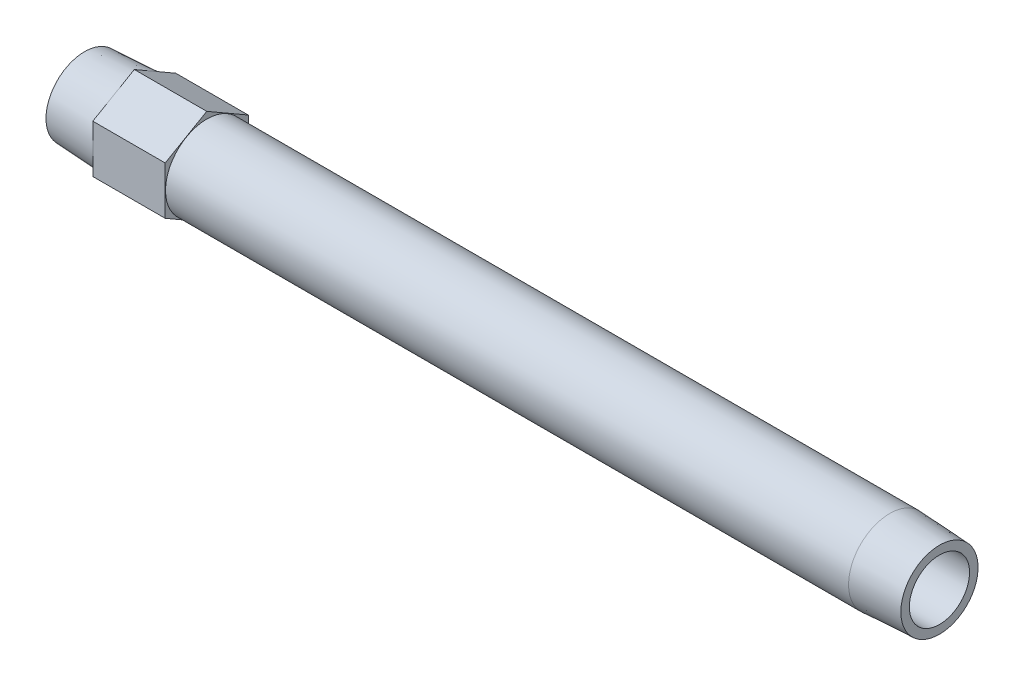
ISO-10303-21;
HEADER;
FILE_DESCRIPTION(('STEP AP214'),'2;1');
FILE_NAME('part.step','',(''),(''),'','','');
FILE_SCHEMA(('AUTOMOTIVE_DESIGN { 1 0 10303 214 1 1 1 1 }'));
ENDSEC;
DATA;
#1=APPLICATION_CONTEXT('core data for automotive mechanical design processes');
#2=APPLICATION_PROTOCOL_DEFINITION('international standard','automotive_design',2000,#1);
#3=PRODUCT_CONTEXT('',#1,'mechanical');
#4=PRODUCT('Part','Part','',(#3));
#5=PRODUCT_RELATED_PRODUCT_CATEGORY('part','',(#4));
#6=PRODUCT_DEFINITION_FORMATION('','',#4);
#7=PRODUCT_DEFINITION_CONTEXT('part definition',#1,'design');
#8=PRODUCT_DEFINITION('design','',#6,#7);
#9=PRODUCT_DEFINITION_SHAPE('','',#8);
#10=(LENGTH_UNIT() NAMED_UNIT(*) SI_UNIT(.MILLI.,.METRE.));
#11=(NAMED_UNIT(*) PLANE_ANGLE_UNIT() SI_UNIT($,.RADIAN.));
#12=(NAMED_UNIT(*) SI_UNIT($,.STERADIAN.) SOLID_ANGLE_UNIT());
#13=UNCERTAINTY_MEASURE_WITH_UNIT(LENGTH_MEASURE(1.E-05),#10,'distance_accuracy_value','');
#14=(GEOMETRIC_REPRESENTATION_CONTEXT(3) GLOBAL_UNCERTAINTY_ASSIGNED_CONTEXT((#13)) GLOBAL_UNIT_ASSIGNED_CONTEXT((#10,
#11,#12)) REPRESENTATION_CONTEXT('',''));
#15=CARTESIAN_POINT('',(0.,0.,0.));
#16=DIRECTION('',(0.,0.,1.));
#17=DIRECTION('',(1.,0.,0.));
#18=AXIS2_PLACEMENT_3D('',#15,#16,#17);
#19=CARTESIAN_POINT('',(0.,0.,-8.03071885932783));
#20=DIRECTION('',(1.,0.,0.));
#21=DIRECTION('',(0.,0.,-1.));
#22=AXIS2_PLACEMENT_3D('',#19,#20,#21);
#23=PLANE('',#22);
#24=CARTESIAN_POINT('',(0.,0.,0.));
#25=DIRECTION('',(-1.,0.,0.));
#26=DIRECTION('',(0.,0.,1.));
#27=AXIS2_PLACEMENT_3D('',#24,#25,#26);
#28=CIRCLE('',#27,8.03071885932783);
#29=CARTESIAN_POINT('',(0.,0.,8.03071885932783));
#30=VERTEX_POINT('',#29);
#31=EDGE_CURVE('E147',#30,#30,#28,.T.);
#32=ORIENTED_EDGE('',*,*,#31,.T.);
#33=EDGE_LOOP('',(#32));
#34=FACE_BOUND('',#33,.T.);
#35=CARTESIAN_POINT('',(0.,0.,0.));
#36=DIRECTION('',(1.,0.,0.));
#37=DIRECTION('',(0.,0.,1.));
#38=AXIS2_PLACEMENT_3D('',#35,#36,#37);
#39=CIRCLE('',#38,6.2611);
#40=CARTESIAN_POINT('',(0.,0.,6.2611));
#41=VERTEX_POINT('',#40);
#42=EDGE_CURVE('E159',#41,#41,#39,.T.);
#43=ORIENTED_EDGE('',*,*,#42,.T.);
#44=EDGE_LOOP('',(#43));
#45=FACE_BOUND('',#44,.T.);
#46=ADVANCED_FACE('F15',(#34,#45),#23,.F.);
#47=CARTESIAN_POINT('',(177.8,0.,-8.0307188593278));
#48=DIRECTION('',(-1.,0.,0.));
#49=DIRECTION('',(0.,0.,1.));
#50=AXIS2_PLACEMENT_3D('',#47,#48,#49);
#51=PLANE('',#50);
#52=CARTESIAN_POINT('',(177.8,0.,0.));
#53=DIRECTION('',(-1.,0.,0.));
#54=DIRECTION('',(0.,0.,1.));
#55=AXIS2_PLACEMENT_3D('',#52,#53,#54);
#56=CIRCLE('',#55,8.0307188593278);
#57=CARTESIAN_POINT('',(177.8,0.,8.0307188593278));
#58=VERTEX_POINT('',#57);
#59=EDGE_CURVE('E150',#58,#58,#56,.T.);
#60=ORIENTED_EDGE('',*,*,#59,.F.);
#61=EDGE_LOOP('',(#60));
#62=FACE_BOUND('',#61,.T.);
#63=CARTESIAN_POINT('',(177.8,0.,0.));
#64=DIRECTION('',(-1.,0.,0.));
#65=DIRECTION('',(0.,0.,1.));
#66=AXIS2_PLACEMENT_3D('',#63,#64,#65);
#67=CIRCLE('',#66,6.2611);
#68=CARTESIAN_POINT('',(177.8,0.,6.2611));
#69=VERTEX_POINT('',#68);
#70=EDGE_CURVE('E156',#69,#69,#67,.F.);
#71=ORIENTED_EDGE('',*,*,#70,.F.);
#72=EDGE_LOOP('',(#71));
#73=FACE_BOUND('',#72,.T.);
#74=ADVANCED_FACE('F178',(#62,#73),#51,.F.);
#75=CARTESIAN_POINT('',(25.4,-4.9859969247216,-8.636));
#76=DIRECTION('',(1.,0.,0.));
#77=DIRECTION('',(0.,1.,0.));
#78=AXIS2_PLACEMENT_3D('',#75,#76,#77);
#79=PLANE('',#78);
#80=DIRECTION('',(0.,0.5,-0.866025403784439));
#81=VECTOR('',#80,1.);
#82=CARTESIAN_POINT('',(25.4,-9.97199384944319,0.));
#83=LINE('',#82,#81);
#84=CARTESIAN_POINT('',(25.4,-9.97199384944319,0.));
#85=VERTEX_POINT('',#84);
#86=CARTESIAN_POINT('',(25.4,-4.9859969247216,-8.636));
#87=VERTEX_POINT('',#86);
#88=EDGE_CURVE('E103',#85,#87,#83,.T.);
#89=ORIENTED_EDGE('',*,*,#88,.T.);
#90=DIRECTION('',(0.,1.,0.));
#91=VECTOR('',#90,1.);
#92=CARTESIAN_POINT('',(25.4,-4.9859969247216,-8.636));
#93=LINE('',#92,#91);
#94=CARTESIAN_POINT('',(25.4,4.9859969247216,-8.636));
#95=VERTEX_POINT('',#94);
#96=EDGE_CURVE('E83',#87,#95,#93,.T.);
#97=ORIENTED_EDGE('',*,*,#96,.T.);
#98=DIRECTION('',(0.,0.5,0.866025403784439));
#99=VECTOR('',#98,1.);
#100=CARTESIAN_POINT('',(25.4,4.9859969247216,-8.636));
#101=LINE('',#100,#99);
#102=CARTESIAN_POINT('',(25.4,9.97199384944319,0.));
#103=VERTEX_POINT('',#102);
#104=EDGE_CURVE('E102',#95,#103,#101,.T.);
#105=ORIENTED_EDGE('',*,*,#104,.T.);
#106=DIRECTION('',(0.,-0.5,0.866025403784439));
#107=VECTOR('',#106,1.);
#108=CARTESIAN_POINT('',(25.4,9.97199384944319,0.));
#109=LINE('',#108,#107);
#110=CARTESIAN_POINT('',(25.4,4.9859969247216,8.636));
#111=VERTEX_POINT('',#110);
#112=EDGE_CURVE('E105',#103,#111,#109,.T.);
#113=ORIENTED_EDGE('',*,*,#112,.T.);
#114=DIRECTION('',(0.,-1.,0.));
#115=VECTOR('',#114,1.);
#116=CARTESIAN_POINT('',(25.4,4.9859969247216,8.636));
#117=LINE('',#116,#115);
#118=CARTESIAN_POINT('',(25.4,-4.9859969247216,8.636));
#119=VERTEX_POINT('',#118);
#120=EDGE_CURVE('E35',#111,#119,#117,.T.);
#121=ORIENTED_EDGE('',*,*,#120,.T.);
#122=DIRECTION('',(0.,-0.5,-0.866025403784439));
#123=VECTOR('',#122,1.);
#124=CARTESIAN_POINT('',(25.4,-4.9859969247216,8.636));
#125=LINE('',#124,#123);
#126=EDGE_CURVE('E30',#119,#85,#125,.T.);
#127=ORIENTED_EDGE('',*,*,#126,.T.);
#128=EDGE_LOOP('',(#89,#97,#105,#113,#121,#127));
#129=FACE_BOUND('',#128,.T.);
#130=CARTESIAN_POINT('',(25.4,0.,0.));
#131=DIRECTION('',(1.,0.,0.));
#132=DIRECTION('',(0.,1.,0.));
#133=AXIS2_PLACEMENT_3D('',#130,#131,#132);
#134=CIRCLE('',#133,8.5725);
#135=CARTESIAN_POINT('',(25.4,8.5725,0.));
#136=VERTEX_POINT('',#135);
#137=EDGE_CURVE('E89',#136,#136,#134,.F.);
#138=ORIENTED_EDGE('',*,*,#137,.T.);
#139=EDGE_LOOP('',(#138));
#140=FACE_BOUND('',#139,.T.);
#141=ADVANCED_FACE('F124',(#129,#140),#79,.T.);
#142=CARTESIAN_POINT('',(10.3378,-4.9859969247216,-8.636));
#143=DIRECTION('',(1.,0.,0.));
#144=DIRECTION('',(0.,1.,0.));
#145=AXIS2_PLACEMENT_3D('',#142,#143,#144);
#146=PLANE('',#145);
#147=DIRECTION('',(0.,0.5,-0.866025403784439));
#148=VECTOR('',#147,1.);
#149=CARTESIAN_POINT('',(10.3378,-9.97199384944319,0.));
#150=LINE('',#149,#148);
#151=CARTESIAN_POINT('',(10.3378,-9.97199384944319,0.));
#152=VERTEX_POINT('',#151);
#153=CARTESIAN_POINT('',(10.3378,-4.9859969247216,-8.636));
#154=VERTEX_POINT('',#153);
#155=EDGE_CURVE('E73',#152,#154,#150,.T.);
#156=ORIENTED_EDGE('',*,*,#155,.F.);
#157=DIRECTION('',(0.,-0.5,-0.866025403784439));
#158=VECTOR('',#157,1.);
#159=CARTESIAN_POINT('',(10.3378,-4.9859969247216,8.636));
#160=LINE('',#159,#158);
#161=CARTESIAN_POINT('',(10.3378,-4.9859969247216,8.636));
#162=VERTEX_POINT('',#161);
#163=EDGE_CURVE('E99',#162,#152,#160,.T.);
#164=ORIENTED_EDGE('',*,*,#163,.F.);
#165=DIRECTION('',(0.,-1.,0.));
#166=VECTOR('',#165,1.);
#167=CARTESIAN_POINT('',(10.3378,4.9859969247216,8.636));
#168=LINE('',#167,#166);
#169=CARTESIAN_POINT('',(10.3378,4.9859969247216,8.636));
#170=VERTEX_POINT('',#169);
#171=EDGE_CURVE('E133',#170,#162,#168,.T.);
#172=ORIENTED_EDGE('',*,*,#171,.F.);
#173=DIRECTION('',(0.,-0.5,0.866025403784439));
#174=VECTOR('',#173,1.);
#175=CARTESIAN_POINT('',(10.3378,9.97199384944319,0.));
#176=LINE('',#175,#174);
#177=CARTESIAN_POINT('',(10.3378,9.97199384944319,0.));
#178=VERTEX_POINT('',#177);
#179=EDGE_CURVE('E129',#178,#170,#176,.T.);
#180=ORIENTED_EDGE('',*,*,#179,.F.);
#181=DIRECTION('',(0.,0.5,0.866025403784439));
#182=VECTOR('',#181,1.);
#183=CARTESIAN_POINT('',(10.3378,4.9859969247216,-8.636));
#184=LINE('',#183,#182);
#185=CARTESIAN_POINT('',(10.3378,4.9859969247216,-8.636));
#186=VERTEX_POINT('',#185);
#187=EDGE_CURVE('E75',#186,#178,#184,.T.);
#188=ORIENTED_EDGE('',*,*,#187,.F.);
#189=DIRECTION('',(0.,1.,0.));
#190=VECTOR('',#189,1.);
#191=CARTESIAN_POINT('',(10.3378,-4.9859969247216,-8.636));
#192=LINE('',#191,#190);
#193=EDGE_CURVE('E68',#154,#186,#192,.T.);
#194=ORIENTED_EDGE('',*,*,#193,.F.);
#195=EDGE_LOOP('',(#156,#164,#172,#180,#188,#194));
#196=FACE_BOUND('',#195,.T.);
#197=CARTESIAN_POINT('',(10.3378,0.,0.));
#198=DIRECTION('',(-1.,0.,0.));
#199=DIRECTION('',(0.,0.,1.));
#200=AXIS2_PLACEMENT_3D('',#197,#198,#199);
#201=CIRCLE('',#200,8.5725);
#202=CARTESIAN_POINT('',(10.3378,0.,8.5725));
#203=VERTEX_POINT('',#202);
#204=EDGE_CURVE('E95',#203,#203,#201,.T.);
#205=ORIENTED_EDGE('',*,*,#204,.F.);
#206=EDGE_LOOP('',(#205));
#207=FACE_BOUND('',#206,.T.);
#208=ADVANCED_FACE('F69',(#196,#207),#146,.F.);
#209=CARTESIAN_POINT('',(25.4,-9.97199384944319,0.));
#210=DIRECTION('',(0.,0.866025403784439,0.5));
#211=DIRECTION('',(0.,-0.5,0.866025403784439));
#212=AXIS2_PLACEMENT_3D('',#209,#210,#211);
#213=PLANE('',#212);
#214=ORIENTED_EDGE('',*,*,#155,.T.);
#215=DIRECTION('',(-1.,0.,0.));
#216=VECTOR('',#215,1.);
#217=CARTESIAN_POINT('',(25.4,-4.9859969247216,-8.636));
#218=LINE('',#217,#216);
#219=EDGE_CURVE('E10',#87,#154,#218,.T.);
#220=ORIENTED_EDGE('',*,*,#219,.F.);
#221=ORIENTED_EDGE('',*,*,#88,.F.);
#222=DIRECTION('',(-1.,0.,0.));
#223=VECTOR('',#222,1.);
#224=CARTESIAN_POINT('',(25.4,-9.97199384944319,0.));
#225=LINE('',#224,#223);
#226=EDGE_CURVE('E87',#85,#152,#225,.T.);
#227=ORIENTED_EDGE('',*,*,#226,.T.);
#228=EDGE_LOOP('',(#214,#220,#221,#227));
#229=FACE_BOUND('',#228,.T.);
#230=ADVANCED_FACE('F17',(#229),#213,.F.);
#231=CARTESIAN_POINT('',(25.4,-4.9859969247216,-8.636));
#232=DIRECTION('',(0.,0.,1.));
#233=DIRECTION('',(1.,0.,0.));
#234=AXIS2_PLACEMENT_3D('',#231,#232,#233);
#235=PLANE('',#234);
#236=ORIENTED_EDGE('',*,*,#193,.T.);
#237=DIRECTION('',(-1.,0.,0.));
#238=VECTOR('',#237,1.);
#239=CARTESIAN_POINT('',(25.4,4.9859969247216,-8.636));
#240=LINE('',#239,#238);
#241=EDGE_CURVE('E23',#95,#186,#240,.T.);
#242=ORIENTED_EDGE('',*,*,#241,.F.);
#243=ORIENTED_EDGE('',*,*,#96,.F.);
#244=ORIENTED_EDGE('',*,*,#219,.T.);
#245=EDGE_LOOP('',(#236,#242,#243,#244));
#246=FACE_BOUND('',#245,.T.);
#247=ADVANCED_FACE('F82',(#246),#235,.F.);
#248=CARTESIAN_POINT('',(25.4,4.9859969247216,-8.636));
#249=DIRECTION('',(0.,-0.866025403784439,0.5));
#250=DIRECTION('',(0.,-0.5,-0.866025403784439));
#251=AXIS2_PLACEMENT_3D('',#248,#249,#250);
#252=PLANE('',#251);
#253=ORIENTED_EDGE('',*,*,#187,.T.);
#254=DIRECTION('',(-1.,0.,0.));
#255=VECTOR('',#254,1.);
#256=CARTESIAN_POINT('',(25.4,9.97199384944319,0.));
#257=LINE('',#256,#255);
#258=EDGE_CURVE('E117',#103,#178,#257,.T.);
#259=ORIENTED_EDGE('',*,*,#258,.F.);
#260=ORIENTED_EDGE('',*,*,#104,.F.);
#261=ORIENTED_EDGE('',*,*,#241,.T.);
#262=EDGE_LOOP('',(#253,#259,#260,#261));
#263=FACE_BOUND('',#262,.T.);
#264=ADVANCED_FACE('F121',(#263),#252,.F.);
#265=CARTESIAN_POINT('',(25.4,9.97199384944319,0.));
#266=DIRECTION('',(0.,-0.866025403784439,-0.5));
#267=DIRECTION('',(0.,0.5,-0.866025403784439));
#268=AXIS2_PLACEMENT_3D('',#265,#266,#267);
#269=PLANE('',#268);
#270=ORIENTED_EDGE('',*,*,#179,.T.);
#271=DIRECTION('',(-1.,0.,0.));
#272=VECTOR('',#271,1.);
#273=CARTESIAN_POINT('',(25.4,4.9859969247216,8.636));
#274=LINE('',#273,#272);
#275=EDGE_CURVE('E114',#111,#170,#274,.T.);
#276=ORIENTED_EDGE('',*,*,#275,.F.);
#277=ORIENTED_EDGE('',*,*,#112,.F.);
#278=ORIENTED_EDGE('',*,*,#258,.T.);
#279=EDGE_LOOP('',(#270,#276,#277,#278));
#280=FACE_BOUND('',#279,.T.);
#281=ADVANCED_FACE('F128',(#280),#269,.F.);
#282=CARTESIAN_POINT('',(25.4,4.9859969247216,8.636));
#283=DIRECTION('',(0.,0.,-1.));
#284=DIRECTION('',(-1.,0.,0.));
#285=AXIS2_PLACEMENT_3D('',#282,#283,#284);
#286=PLANE('',#285);
#287=ORIENTED_EDGE('',*,*,#171,.T.);
#288=DIRECTION('',(-1.,0.,0.));
#289=VECTOR('',#288,1.);
#290=CARTESIAN_POINT('',(25.4,-4.9859969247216,8.636));
#291=LINE('',#290,#289);
#292=EDGE_CURVE('E111',#119,#162,#291,.T.);
#293=ORIENTED_EDGE('',*,*,#292,.F.);
#294=ORIENTED_EDGE('',*,*,#120,.F.);
#295=ORIENTED_EDGE('',*,*,#275,.T.);
#296=EDGE_LOOP('',(#287,#293,#294,#295));
#297=FACE_BOUND('',#296,.T.);
#298=ADVANCED_FACE('F132',(#297),#286,.F.);
#299=CARTESIAN_POINT('',(25.4,-4.9859969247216,8.636));
#300=DIRECTION('',(0.,0.866025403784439,-0.5));
#301=DIRECTION('',(0.,0.5,0.866025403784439));
#302=AXIS2_PLACEMENT_3D('',#299,#300,#301);
#303=PLANE('',#302);
#304=ORIENTED_EDGE('',*,*,#163,.T.);
#305=ORIENTED_EDGE('',*,*,#226,.F.);
#306=ORIENTED_EDGE('',*,*,#126,.F.);
#307=ORIENTED_EDGE('',*,*,#292,.T.);
#308=EDGE_LOOP('',(#304,#305,#306,#307));
#309=FACE_BOUND('',#308,.T.);
#310=ADVANCED_FACE('F135',(#309),#303,.F.);
#311=CARTESIAN_POINT('',(10.3378,0.,0.));
#312=DIRECTION('',(1.,0.,0.));
#313=DIRECTION('',(0.,0.,-1.));
#314=AXIS2_PLACEMENT_3D('',#311,#312,#313);
#315=CONICAL_SURFACE('',#314,8.5725,0.0523598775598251);
#316=ORIENTED_EDGE('',*,*,#31,.F.);
#317=EDGE_LOOP('',(#316));
#318=FACE_BOUND('',#317,.T.);
#319=ORIENTED_EDGE('',*,*,#204,.T.);
#320=EDGE_LOOP('',(#319));
#321=FACE_BOUND('',#320,.T.);
#322=ADVANCED_FACE('F187',(#318,#321),#315,.T.);
#323=CARTESIAN_POINT('',(-60.,0.,0.));
#324=DIRECTION('',(-1.,0.,0.));
#325=DIRECTION('',(0.,0.,1.));
#326=AXIS2_PLACEMENT_3D('',#323,#324,#325);
#327=CYLINDRICAL_SURFACE('',#326,8.5725);
#328=ORIENTED_EDGE('',*,*,#137,.F.);
#329=EDGE_LOOP('',(#328));
#330=FACE_BOUND('',#329,.T.);
#331=CARTESIAN_POINT('',(167.4622,0.,0.));
#332=DIRECTION('',(-1.,0.,0.));
#333=DIRECTION('',(0.,0.,1.));
#334=AXIS2_PLACEMENT_3D('',#331,#332,#333);
#335=CIRCLE('',#334,8.5725);
#336=CARTESIAN_POINT('',(167.4622,0.,8.5725));
#337=VERTEX_POINT('',#336);
#338=EDGE_CURVE('E153',#337,#337,#335,.T.);
#339=ORIENTED_EDGE('',*,*,#338,.T.);
#340=EDGE_LOOP('',(#339));
#341=FACE_BOUND('',#340,.T.);
#342=ADVANCED_FACE('F174',(#330,#341),#327,.T.);
#343=CARTESIAN_POINT('',(177.8,0.,0.));
#344=DIRECTION('',(-1.,0.,0.));
#345=DIRECTION('',(0.,0.,1.));
#346=AXIS2_PLACEMENT_3D('',#343,#344,#345);
#347=CONICAL_SURFACE('',#346,8.0307188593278,0.0523598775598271);
#348=ORIENTED_EDGE('',*,*,#338,.F.);
#349=EDGE_LOOP('',(#348));
#350=FACE_BOUND('',#349,.T.);
#351=ORIENTED_EDGE('',*,*,#59,.T.);
#352=EDGE_LOOP('',(#351));
#353=FACE_BOUND('',#352,.T.);
#354=ADVANCED_FACE('F167',(#350,#353),#347,.T.);
#355=CARTESIAN_POINT('',(179.746834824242,0.,0.));
#356=DIRECTION('',(-1.,0.,0.));
#357=DIRECTION('',(0.,0.,1.));
#358=AXIS2_PLACEMENT_3D('',#355,#356,#357);
#359=CYLINDRICAL_SURFACE('',#358,6.2611);
#360=ORIENTED_EDGE('',*,*,#70,.T.);
#361=EDGE_LOOP('',(#360));
#362=FACE_BOUND('',#361,.T.);
#363=ORIENTED_EDGE('',*,*,#42,.F.);
#364=EDGE_LOOP('',(#363));
#365=FACE_BOUND('',#364,.T.);
#366=ADVANCED_FACE('F165',(#362,#365),#359,.F.);
#367=CLOSED_SHELL('',(#46,#74,#141,#208,#230,#247,#264,#281,#298,#310,#322,#342,#354,#366));
#368=MANIFOLD_SOLID_BREP('B1',#367);
#369=ADVANCED_BREP_SHAPE_REPRESENTATION('',(#18,#368),#14);
#370=SHAPE_DEFINITION_REPRESENTATION(#9,#369);
ENDSEC;
END-ISO-10303-21;
